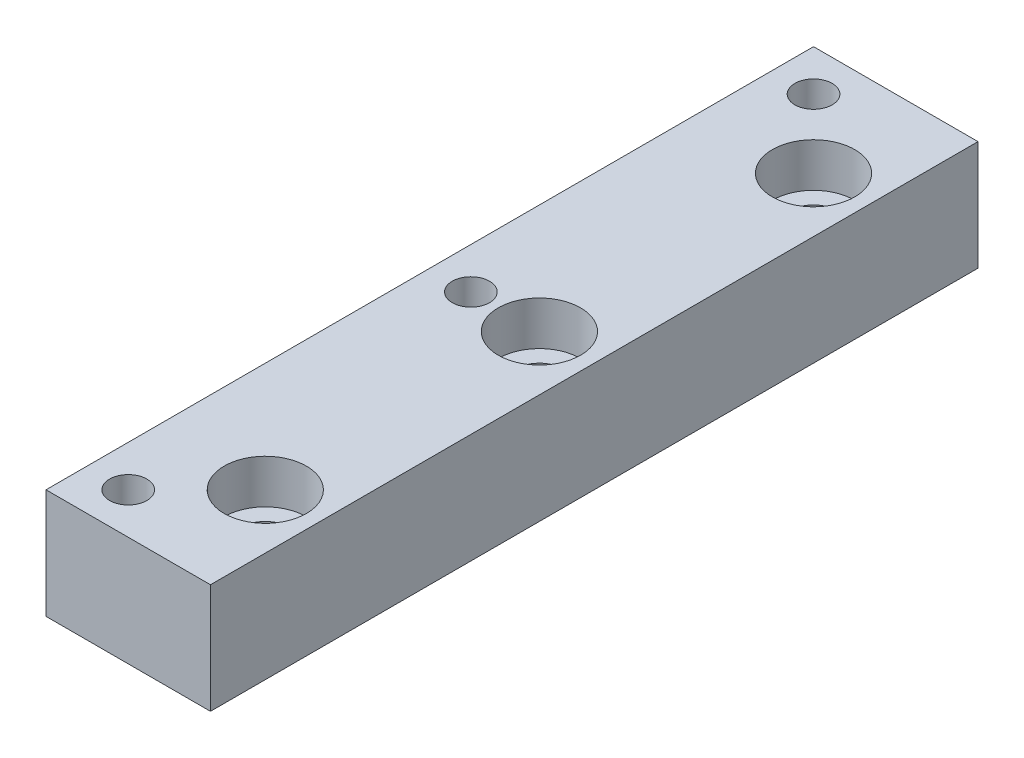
ISO-10303-21;
HEADER;
FILE_DESCRIPTION(('STEP AP214'),'2;1');
FILE_NAME('part.step','',(''),(''),'','','');
FILE_SCHEMA(('AUTOMOTIVE_DESIGN { 1 0 10303 214 1 1 1 1 }'));
ENDSEC;
DATA;
#1=APPLICATION_CONTEXT('core data for automotive mechanical design processes');
#2=APPLICATION_PROTOCOL_DEFINITION('international standard','automotive_design',2000,#1);
#3=PRODUCT_CONTEXT('',#1,'mechanical');
#4=PRODUCT('Part','Part','',(#3));
#5=PRODUCT_RELATED_PRODUCT_CATEGORY('part','',(#4));
#6=PRODUCT_DEFINITION_FORMATION('','',#4);
#7=PRODUCT_DEFINITION_CONTEXT('part definition',#1,'design');
#8=PRODUCT_DEFINITION('design','',#6,#7);
#9=PRODUCT_DEFINITION_SHAPE('','',#8);
#10=(LENGTH_UNIT() NAMED_UNIT(*) SI_UNIT(.MILLI.,.METRE.));
#11=(NAMED_UNIT(*) PLANE_ANGLE_UNIT() SI_UNIT($,.RADIAN.));
#12=(NAMED_UNIT(*) SI_UNIT($,.STERADIAN.) SOLID_ANGLE_UNIT());
#13=UNCERTAINTY_MEASURE_WITH_UNIT(LENGTH_MEASURE(1.E-05),#10,'distance_accuracy_value','');
#14=(GEOMETRIC_REPRESENTATION_CONTEXT(3) GLOBAL_UNCERTAINTY_ASSIGNED_CONTEXT((#13)) GLOBAL_UNIT_ASSIGNED_CONTEXT((#10,
#11,#12)) REPRESENTATION_CONTEXT('',''));
#15=CARTESIAN_POINT('',(0.,0.,0.));
#16=DIRECTION('',(0.,0.,1.));
#17=DIRECTION('',(1.,0.,0.));
#18=AXIS2_PLACEMENT_3D('',#15,#16,#17);
#19=CARTESIAN_POINT('',(0.,-2.22044604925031E-13,-70.0000000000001));
#20=DIRECTION('',(0.,-1.,0.));
#21=DIRECTION('',(0.,0.,-1.));
#22=AXIS2_PLACEMENT_3D('',#19,#20,#21);
#23=PLANE('',#22);
#24=CARTESIAN_POINT('',(19.9999999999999,0.,49.9999999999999));
#25=DIRECTION('',(0.,1.,0.));
#26=DIRECTION('',(0.,0.,1.));
#27=AXIS2_PLACEMENT_3D('',#24,#25,#26);
#28=CIRCLE('',#27,4.25);
#29=CARTESIAN_POINT('',(19.9999999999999,0.,54.2499999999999));
#30=VERTEX_POINT('',#29);
#31=EDGE_CURVE('E129',#30,#30,#28,.T.);
#32=ORIENTED_EDGE('',*,*,#31,.T.);
#33=EDGE_LOOP('',(#32));
#34=FACE_BOUND('',#33,.T.);
#35=CARTESIAN_POINT('',(20.,0.,-1.11022302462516E-13));
#36=DIRECTION('',(0.,1.,0.));
#37=DIRECTION('',(0.,0.,1.));
#38=AXIS2_PLACEMENT_3D('',#35,#36,#37);
#39=CIRCLE('',#38,4.25);
#40=CARTESIAN_POINT('',(20.,0.,4.24999999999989));
#41=VERTEX_POINT('',#40);
#42=EDGE_CURVE('E140',#41,#41,#39,.T.);
#43=ORIENTED_EDGE('',*,*,#42,.T.);
#44=EDGE_LOOP('',(#43));
#45=FACE_BOUND('',#44,.T.);
#46=CARTESIAN_POINT('',(20.,0.,-50.0000000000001));
#47=DIRECTION('',(0.,1.,0.));
#48=DIRECTION('',(0.,0.,1.));
#49=AXIS2_PLACEMENT_3D('',#46,#47,#48);
#50=CIRCLE('',#49,4.25);
#51=CARTESIAN_POINT('',(20.,0.,-45.7500000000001));
#52=VERTEX_POINT('',#51);
#53=EDGE_CURVE('E146',#52,#52,#50,.T.);
#54=ORIENTED_EDGE('',*,*,#53,.T.);
#55=EDGE_LOOP('',(#54));
#56=FACE_BOUND('',#55,.T.);
#57=CARTESIAN_POINT('',(7.50000000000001,0.,62.5));
#58=DIRECTION('',(0.,1.,0.));
#59=DIRECTION('',(0.,0.,1.));
#60=AXIS2_PLACEMENT_3D('',#57,#58,#59);
#61=CIRCLE('',#60,3.4);
#62=CARTESIAN_POINT('',(7.50000000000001,0.,65.9));
#63=VERTEX_POINT('',#62);
#64=EDGE_CURVE('E182',#63,#63,#61,.T.);
#65=ORIENTED_EDGE('',*,*,#64,.T.);
#66=EDGE_LOOP('',(#65));
#67=FACE_BOUND('',#66,.T.);
#68=CARTESIAN_POINT('',(7.50000000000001,0.,0.));
#69=DIRECTION('',(0.,1.,0.));
#70=DIRECTION('',(0.,0.,1.));
#71=AXIS2_PLACEMENT_3D('',#68,#69,#70);
#72=CIRCLE('',#71,3.4);
#73=CARTESIAN_POINT('',(7.50000000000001,0.,3.39999999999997));
#74=VERTEX_POINT('',#73);
#75=EDGE_CURVE('E158',#74,#74,#72,.T.);
#76=ORIENTED_EDGE('',*,*,#75,.T.);
#77=EDGE_LOOP('',(#76));
#78=FACE_BOUND('',#77,.T.);
#79=DIRECTION('',(0.999999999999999,0.,0.));
#80=VECTOR('',#79,1.);
#81=CARTESIAN_POINT('',(0.,0.,70.));
#82=LINE('',#81,#80);
#83=CARTESIAN_POINT('',(0.,0.,70.));
#84=VERTEX_POINT('',#83);
#85=CARTESIAN_POINT('',(30.,0.,69.9999999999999));
#86=VERTEX_POINT('',#85);
#87=EDGE_CURVE('E92',#84,#86,#82,.T.);
#88=ORIENTED_EDGE('',*,*,#87,.F.);
#89=DIRECTION('',(0.,0.,1.));
#90=VECTOR('',#89,1.);
#91=CARTESIAN_POINT('',(0.,-2.22044604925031E-13,-70.0000000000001));
#92=LINE('',#91,#90);
#93=CARTESIAN_POINT('',(0.,-2.22044604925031E-13,-70.0000000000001));
#94=VERTEX_POINT('',#93);
#95=EDGE_CURVE('E44',#94,#84,#92,.T.);
#96=ORIENTED_EDGE('',*,*,#95,.F.);
#97=DIRECTION('',(0.999999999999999,0.,0.));
#98=VECTOR('',#97,1.);
#99=CARTESIAN_POINT('',(0.,-2.22044604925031E-13,-70.0000000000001));
#100=LINE('',#99,#98);
#101=CARTESIAN_POINT('',(30.0000000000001,-2.77555756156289E-13,-70.0000000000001));
#102=VERTEX_POINT('',#101);
#103=EDGE_CURVE('E119',#94,#102,#100,.T.);
#104=ORIENTED_EDGE('',*,*,#103,.T.);
#105=DIRECTION('',(0.,0.,1.));
#106=VECTOR('',#105,1.);
#107=CARTESIAN_POINT('',(30.0000000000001,-2.77555756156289E-13,-70.0000000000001));
#108=LINE('',#107,#106);
#109=EDGE_CURVE('E89',#102,#86,#108,.T.);
#110=ORIENTED_EDGE('',*,*,#109,.T.);
#111=EDGE_LOOP('',(#88,#96,#104,#110));
#112=FACE_BOUND('',#111,.T.);
#113=CARTESIAN_POINT('',(7.50000000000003,-2.22044604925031E-13,-62.5));
#114=DIRECTION('',(0.,1.,0.));
#115=DIRECTION('',(0.,0.,1.));
#116=AXIS2_PLACEMENT_3D('',#113,#114,#115);
#117=CIRCLE('',#116,3.4);
#118=CARTESIAN_POINT('',(7.50000000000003,-2.22044604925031E-13,-59.1));
#119=VERTEX_POINT('',#118);
#120=EDGE_CURVE('E109',#119,#119,#117,.T.);
#121=ORIENTED_EDGE('',*,*,#120,.T.);
#122=EDGE_LOOP('',(#121));
#123=FACE_BOUND('',#122,.T.);
#124=ADVANCED_FACE('F40',(#34,#45,#56,#67,#78,#112,#123),#23,.T.);
#125=CARTESIAN_POINT('',(0.,-2.22044604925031E-13,-70.0000000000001));
#126=DIRECTION('',(-0.999999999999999,0.,0.));
#127=DIRECTION('',(0.,0.,1.));
#128=AXIS2_PLACEMENT_3D('',#125,#126,#127);
#129=PLANE('',#128);
#130=DIRECTION('',(0.,-1.,0.));
#131=VECTOR('',#130,1.);
#132=CARTESIAN_POINT('',(0.,0.,70.));
#133=LINE('',#132,#131);
#134=CARTESIAN_POINT('',(0.,20.,70.));
#135=VERTEX_POINT('',#134);
#136=EDGE_CURVE('E82',#135,#84,#133,.T.);
#137=ORIENTED_EDGE('',*,*,#136,.F.);
#138=DIRECTION('',(0.,0.,1.));
#139=VECTOR('',#138,1.);
#140=CARTESIAN_POINT('',(0.,19.9999999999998,-70.0000000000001));
#141=LINE('',#140,#139);
#142=CARTESIAN_POINT('',(0.,19.9999999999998,-70.0000000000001));
#143=VERTEX_POINT('',#142);
#144=EDGE_CURVE('E11',#143,#135,#141,.T.);
#145=ORIENTED_EDGE('',*,*,#144,.F.);
#146=DIRECTION('',(0.,-1.,0.));
#147=VECTOR('',#146,1.);
#148=CARTESIAN_POINT('',(0.,-2.22044604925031E-13,-70.0000000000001));
#149=LINE('',#148,#147);
#150=EDGE_CURVE('E84',#143,#94,#149,.T.);
#151=ORIENTED_EDGE('',*,*,#150,.T.);
#152=ORIENTED_EDGE('',*,*,#95,.T.);
#153=EDGE_LOOP('',(#137,#145,#151,#152));
#154=FACE_BOUND('',#153,.T.);
#155=ADVANCED_FACE('F42',(#154),#129,.T.);
#156=CARTESIAN_POINT('',(0.,19.9999999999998,-70.0000000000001));
#157=DIRECTION('',(0.,1.,0.));
#158=DIRECTION('',(0.,0.,1.));
#159=AXIS2_PLACEMENT_3D('',#156,#157,#158);
#160=PLANE('',#159);
#161=CARTESIAN_POINT('',(20.,20.,49.9999999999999));
#162=DIRECTION('',(0.,1.,0.));
#163=DIRECTION('',(0.,0.,1.));
#164=AXIS2_PLACEMENT_3D('',#161,#162,#163);
#165=CIRCLE('',#164,7.5);
#166=CARTESIAN_POINT('',(20.,20.,57.4999999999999));
#167=VERTEX_POINT('',#166);
#168=EDGE_CURVE('E138',#167,#167,#165,.T.);
#169=ORIENTED_EDGE('',*,*,#168,.F.);
#170=EDGE_LOOP('',(#169));
#171=FACE_BOUND('',#170,.T.);
#172=CARTESIAN_POINT('',(20.,20.,-1.38777878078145E-13));
#173=DIRECTION('',(0.,1.,0.));
#174=DIRECTION('',(0.,0.,1.));
#175=AXIS2_PLACEMENT_3D('',#172,#173,#174);
#176=CIRCLE('',#175,7.5);
#177=CARTESIAN_POINT('',(20.,20.,7.49999999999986));
#178=VERTEX_POINT('',#177);
#179=EDGE_CURVE('E143',#178,#178,#176,.T.);
#180=ORIENTED_EDGE('',*,*,#179,.F.);
#181=EDGE_LOOP('',(#180));
#182=FACE_BOUND('',#181,.T.);
#183=CARTESIAN_POINT('',(20.,20.,-50.0000000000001));
#184=DIRECTION('',(0.,1.,0.));
#185=DIRECTION('',(0.,0.,1.));
#186=AXIS2_PLACEMENT_3D('',#183,#184,#185);
#187=CIRCLE('',#186,7.5);
#188=CARTESIAN_POINT('',(20.,20.,-42.5000000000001));
#189=VERTEX_POINT('',#188);
#190=EDGE_CURVE('E178',#189,#189,#187,.T.);
#191=ORIENTED_EDGE('',*,*,#190,.F.);
#192=EDGE_LOOP('',(#191));
#193=FACE_BOUND('',#192,.T.);
#194=CARTESIAN_POINT('',(7.50000000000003,20.,62.5));
#195=DIRECTION('',(0.,1.,0.));
#196=DIRECTION('',(0.,0.,1.));
#197=AXIS2_PLACEMENT_3D('',#194,#195,#196);
#198=CIRCLE('',#197,3.4);
#199=CARTESIAN_POINT('',(7.50000000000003,20.,65.9));
#200=VERTEX_POINT('',#199);
#201=EDGE_CURVE('E186',#200,#200,#198,.T.);
#202=ORIENTED_EDGE('',*,*,#201,.F.);
#203=EDGE_LOOP('',(#202));
#204=FACE_BOUND('',#203,.T.);
#205=CARTESIAN_POINT('',(7.49999999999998,20.,0.));
#206=DIRECTION('',(0.,1.,0.));
#207=DIRECTION('',(0.,0.,1.));
#208=AXIS2_PLACEMENT_3D('',#205,#206,#207);
#209=CIRCLE('',#208,3.4);
#210=CARTESIAN_POINT('',(7.49999999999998,20.,3.39999999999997));
#211=VERTEX_POINT('',#210);
#212=EDGE_CURVE('E151',#211,#211,#209,.T.);
#213=ORIENTED_EDGE('',*,*,#212,.F.);
#214=EDGE_LOOP('',(#213));
#215=FACE_BOUND('',#214,.T.);
#216=CARTESIAN_POINT('',(7.49999999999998,19.9999999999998,-62.5));
#217=DIRECTION('',(0.,1.,0.));
#218=DIRECTION('',(0.,0.,1.));
#219=AXIS2_PLACEMENT_3D('',#216,#217,#218);
#220=CIRCLE('',#219,3.4);
#221=CARTESIAN_POINT('',(7.49999999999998,19.9999999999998,-59.1));
#222=VERTEX_POINT('',#221);
#223=EDGE_CURVE('E103',#222,#222,#220,.T.);
#224=ORIENTED_EDGE('',*,*,#223,.F.);
#225=EDGE_LOOP('',(#224));
#226=FACE_BOUND('',#225,.T.);
#227=DIRECTION('',(-0.999999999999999,0.,0.));
#228=VECTOR('',#227,1.);
#229=CARTESIAN_POINT('',(0.,20.,70.));
#230=LINE('',#229,#228);
#231=CARTESIAN_POINT('',(30.,20.,69.9999999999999));
#232=VERTEX_POINT('',#231);
#233=EDGE_CURVE('E101',#232,#135,#230,.T.);
#234=ORIENTED_EDGE('',*,*,#233,.F.);
#235=DIRECTION('',(0.,0.,1.));
#236=VECTOR('',#235,1.);
#237=CARTESIAN_POINT('',(30.,19.9999999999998,-70.0000000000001));
#238=LINE('',#237,#236);
#239=CARTESIAN_POINT('',(30.,19.9999999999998,-70.0000000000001));
#240=VERTEX_POINT('',#239);
#241=EDGE_CURVE('E50',#240,#232,#238,.T.);
#242=ORIENTED_EDGE('',*,*,#241,.F.);
#243=DIRECTION('',(-0.999999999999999,0.,0.));
#244=VECTOR('',#243,1.);
#245=CARTESIAN_POINT('',(0.,19.9999999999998,-70.0000000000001));
#246=LINE('',#245,#244);
#247=EDGE_CURVE('E90',#240,#143,#246,.T.);
#248=ORIENTED_EDGE('',*,*,#247,.T.);
#249=ORIENTED_EDGE('',*,*,#144,.T.);
#250=EDGE_LOOP('',(#234,#242,#248,#249));
#251=FACE_BOUND('',#250,.T.);
#252=ADVANCED_FACE('F203',(#171,#182,#193,#204,#215,#226,#251),#160,.T.);
#253=CARTESIAN_POINT('',(30.0000000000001,-2.77555756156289E-13,-70.0000000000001));
#254=DIRECTION('',(0.999999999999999,0.,0.));
#255=DIRECTION('',(0.,0.,-1.));
#256=AXIS2_PLACEMENT_3D('',#253,#254,#255);
#257=PLANE('',#256);
#258=DIRECTION('',(0.,1.,0.));
#259=VECTOR('',#258,1.);
#260=CARTESIAN_POINT('',(30.,0.,69.9999999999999));
#261=LINE('',#260,#259);
#262=EDGE_CURVE('E98',#86,#232,#261,.T.);
#263=ORIENTED_EDGE('',*,*,#262,.F.);
#264=ORIENTED_EDGE('',*,*,#109,.F.);
#265=DIRECTION('',(0.,1.,0.));
#266=VECTOR('',#265,1.);
#267=CARTESIAN_POINT('',(30.0000000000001,-2.77555756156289E-13,-70.0000000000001));
#268=LINE('',#267,#266);
#269=EDGE_CURVE('E122',#102,#240,#268,.T.);
#270=ORIENTED_EDGE('',*,*,#269,.T.);
#271=ORIENTED_EDGE('',*,*,#241,.T.);
#272=EDGE_LOOP('',(#263,#264,#270,#271));
#273=FACE_BOUND('',#272,.T.);
#274=ADVANCED_FACE('F206',(#273),#257,.T.);
#275=CARTESIAN_POINT('',(0.,19.9999999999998,-70.0000000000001));
#276=DIRECTION('',(0.,0.,-1.));
#277=DIRECTION('',(-0.999999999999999,0.,0.));
#278=AXIS2_PLACEMENT_3D('',#275,#276,#277);
#279=PLANE('',#278);
#280=ORIENTED_EDGE('',*,*,#150,.F.);
#281=ORIENTED_EDGE('',*,*,#247,.F.);
#282=ORIENTED_EDGE('',*,*,#269,.F.);
#283=ORIENTED_EDGE('',*,*,#103,.F.);
#284=EDGE_LOOP('',(#280,#281,#282,#283));
#285=FACE_BOUND('',#284,.T.);
#286=ADVANCED_FACE('F213',(#285),#279,.T.);
#287=CARTESIAN_POINT('',(0.,20.,70.));
#288=DIRECTION('',(0.,0.,-1.));
#289=DIRECTION('',(-0.999999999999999,0.,0.));
#290=AXIS2_PLACEMENT_3D('',#287,#288,#289);
#291=PLANE('',#290);
#292=ORIENTED_EDGE('',*,*,#136,.T.);
#293=ORIENTED_EDGE('',*,*,#87,.T.);
#294=ORIENTED_EDGE('',*,*,#262,.T.);
#295=ORIENTED_EDGE('',*,*,#233,.T.);
#296=EDGE_LOOP('',(#292,#293,#294,#295));
#297=FACE_BOUND('',#296,.T.);
#298=ADVANCED_FACE('F100',(#297),#291,.F.);
#299=CARTESIAN_POINT('',(7.49999999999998,19.9999999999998,-62.5));
#300=DIRECTION('',(0.,1.,0.));
#301=DIRECTION('',(0.,0.,1.));
#302=AXIS2_PLACEMENT_3D('',#299,#300,#301);
#303=CYLINDRICAL_SURFACE('',#302,3.4);
#304=ORIENTED_EDGE('',*,*,#120,.F.);
#305=EDGE_LOOP('',(#304));
#306=FACE_BOUND('',#305,.T.);
#307=ORIENTED_EDGE('',*,*,#223,.T.);
#308=EDGE_LOOP('',(#307));
#309=FACE_BOUND('',#308,.T.);
#310=ADVANCED_FACE('F199',(#306,#309),#303,.F.);
#311=CARTESIAN_POINT('',(7.49999999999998,20.,0.));
#312=DIRECTION('',(0.,1.,0.));
#313=DIRECTION('',(0.,0.,1.));
#314=AXIS2_PLACEMENT_3D('',#311,#312,#313);
#315=CYLINDRICAL_SURFACE('',#314,3.4);
#316=ORIENTED_EDGE('',*,*,#75,.F.);
#317=EDGE_LOOP('',(#316));
#318=FACE_BOUND('',#317,.T.);
#319=ORIENTED_EDGE('',*,*,#212,.T.);
#320=EDGE_LOOP('',(#319));
#321=FACE_BOUND('',#320,.T.);
#322=ADVANCED_FACE('F195',(#318,#321),#315,.F.);
#323=CARTESIAN_POINT('',(7.50000000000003,20.,62.5));
#324=DIRECTION('',(0.,1.,0.));
#325=DIRECTION('',(0.,0.,1.));
#326=AXIS2_PLACEMENT_3D('',#323,#324,#325);
#327=CYLINDRICAL_SURFACE('',#326,3.4);
#328=ORIENTED_EDGE('',*,*,#64,.F.);
#329=EDGE_LOOP('',(#328));
#330=FACE_BOUND('',#329,.T.);
#331=ORIENTED_EDGE('',*,*,#201,.T.);
#332=EDGE_LOOP('',(#331));
#333=FACE_BOUND('',#332,.T.);
#334=ADVANCED_FACE('F198',(#330,#333),#327,.F.);
#335=CARTESIAN_POINT('',(20.,20.,-50.0000000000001));
#336=DIRECTION('',(0.,1.,0.));
#337=DIRECTION('',(0.,0.,1.));
#338=AXIS2_PLACEMENT_3D('',#335,#336,#337);
#339=CYLINDRICAL_SURFACE('',#338,7.5);
#340=CARTESIAN_POINT('',(20.,12.,-50.0000000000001));
#341=DIRECTION('',(0.,1.,0.));
#342=DIRECTION('',(0.,0.,1.));
#343=AXIS2_PLACEMENT_3D('',#340,#341,#342);
#344=CIRCLE('',#343,7.5);
#345=CARTESIAN_POINT('',(20.,12.,-42.5000000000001));
#346=VERTEX_POINT('',#345);
#347=EDGE_CURVE('E163',#346,#346,#344,.T.);
#348=ORIENTED_EDGE('',*,*,#347,.F.);
#349=EDGE_LOOP('',(#348));
#350=FACE_BOUND('',#349,.T.);
#351=ORIENTED_EDGE('',*,*,#190,.T.);
#352=EDGE_LOOP('',(#351));
#353=FACE_BOUND('',#352,.T.);
#354=ADVANCED_FACE('F236',(#350,#353),#339,.F.);
#355=CARTESIAN_POINT('',(24.25,12.,-50.0000000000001));
#356=DIRECTION('',(0.,-1.,0.));
#357=DIRECTION('',(0.,0.,-1.));
#358=AXIS2_PLACEMENT_3D('',#355,#356,#357);
#359=PLANE('',#358);
#360=CARTESIAN_POINT('',(20.,12.,-50.0000000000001));
#361=DIRECTION('',(0.,1.,0.));
#362=DIRECTION('',(0.,0.,1.));
#363=AXIS2_PLACEMENT_3D('',#360,#361,#362);
#364=CIRCLE('',#363,4.25);
#365=CARTESIAN_POINT('',(20.,12.,-45.7500000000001));
#366=VERTEX_POINT('',#365);
#367=EDGE_CURVE('E160',#366,#366,#364,.T.);
#368=ORIENTED_EDGE('',*,*,#367,.F.);
#369=EDGE_LOOP('',(#368));
#370=FACE_BOUND('',#369,.T.);
#371=ORIENTED_EDGE('',*,*,#347,.T.);
#372=EDGE_LOOP('',(#371));
#373=FACE_BOUND('',#372,.T.);
#374=ADVANCED_FACE('F243',(#370,#373),#359,.F.);
#375=CARTESIAN_POINT('',(20.,20.,-50.0000000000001));
#376=DIRECTION('',(0.,1.,0.));
#377=DIRECTION('',(0.,0.,1.));
#378=AXIS2_PLACEMENT_3D('',#375,#376,#377);
#379=CYLINDRICAL_SURFACE('',#378,4.25);
#380=ORIENTED_EDGE('',*,*,#53,.F.);
#381=EDGE_LOOP('',(#380));
#382=FACE_BOUND('',#381,.T.);
#383=ORIENTED_EDGE('',*,*,#367,.T.);
#384=EDGE_LOOP('',(#383));
#385=FACE_BOUND('',#384,.T.);
#386=ADVANCED_FACE('F283',(#382,#385),#379,.F.);
#387=CARTESIAN_POINT('',(20.,20.,-1.38777878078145E-13));
#388=DIRECTION('',(0.,1.,0.));
#389=DIRECTION('',(0.,0.,1.));
#390=AXIS2_PLACEMENT_3D('',#387,#388,#389);
#391=CYLINDRICAL_SURFACE('',#390,7.5);
#392=CARTESIAN_POINT('',(20.,12.,-1.11022302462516E-13));
#393=DIRECTION('',(0.,1.,0.));
#394=DIRECTION('',(0.,0.,1.));
#395=AXIS2_PLACEMENT_3D('',#392,#393,#394);
#396=CIRCLE('',#395,7.5);
#397=CARTESIAN_POINT('',(20.,12.,7.49999999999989));
#398=VERTEX_POINT('',#397);
#399=EDGE_CURVE('E147',#398,#398,#396,.T.);
#400=ORIENTED_EDGE('',*,*,#399,.F.);
#401=EDGE_LOOP('',(#400));
#402=FACE_BOUND('',#401,.T.);
#403=ORIENTED_EDGE('',*,*,#179,.T.);
#404=EDGE_LOOP('',(#403));
#405=FACE_BOUND('',#404,.T.);
#406=ADVANCED_FACE('F291',(#402,#405),#391,.F.);
#407=CARTESIAN_POINT('',(24.25,12.,-1.11022302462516E-13));
#408=DIRECTION('',(0.,-1.,0.));
#409=DIRECTION('',(0.,0.,-1.));
#410=AXIS2_PLACEMENT_3D('',#407,#408,#409);
#411=PLANE('',#410);
#412=CARTESIAN_POINT('',(20.,12.,-1.11022302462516E-13));
#413=DIRECTION('',(0.,1.,0.));
#414=DIRECTION('',(0.,0.,1.));
#415=AXIS2_PLACEMENT_3D('',#412,#413,#414);
#416=CIRCLE('',#415,4.25);
#417=CARTESIAN_POINT('',(20.,12.,4.24999999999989));
#418=VERTEX_POINT('',#417);
#419=EDGE_CURVE('E152',#418,#418,#416,.T.);
#420=ORIENTED_EDGE('',*,*,#419,.F.);
#421=EDGE_LOOP('',(#420));
#422=FACE_BOUND('',#421,.T.);
#423=ORIENTED_EDGE('',*,*,#399,.T.);
#424=EDGE_LOOP('',(#423));
#425=FACE_BOUND('',#424,.T.);
#426=ADVANCED_FACE('F300',(#422,#425),#411,.F.);
#427=CARTESIAN_POINT('',(20.,20.,-1.38777878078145E-13));
#428=DIRECTION('',(0.,1.,0.));
#429=DIRECTION('',(0.,0.,1.));
#430=AXIS2_PLACEMENT_3D('',#427,#428,#429);
#431=CYLINDRICAL_SURFACE('',#430,4.25);
#432=ORIENTED_EDGE('',*,*,#42,.F.);
#433=EDGE_LOOP('',(#432));
#434=FACE_BOUND('',#433,.T.);
#435=ORIENTED_EDGE('',*,*,#419,.T.);
#436=EDGE_LOOP('',(#435));
#437=FACE_BOUND('',#436,.T.);
#438=ADVANCED_FACE('F309',(#434,#437),#431,.F.);
#439=CARTESIAN_POINT('',(20.,20.,49.9999999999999));
#440=DIRECTION('',(0.,1.,0.));
#441=DIRECTION('',(0.,0.,1.));
#442=AXIS2_PLACEMENT_3D('',#439,#440,#441);
#443=CYLINDRICAL_SURFACE('',#442,7.5);
#444=CARTESIAN_POINT('',(20.,12.,49.9999999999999));
#445=DIRECTION('',(0.,1.,0.));
#446=DIRECTION('',(0.,0.,1.));
#447=AXIS2_PLACEMENT_3D('',#444,#445,#446);
#448=CIRCLE('',#447,7.5);
#449=CARTESIAN_POINT('',(20.,12.,57.4999999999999));
#450=VERTEX_POINT('',#449);
#451=EDGE_CURVE('E135',#450,#450,#448,.T.);
#452=ORIENTED_EDGE('',*,*,#451,.F.);
#453=EDGE_LOOP('',(#452));
#454=FACE_BOUND('',#453,.T.);
#455=ORIENTED_EDGE('',*,*,#168,.T.);
#456=EDGE_LOOP('',(#455));
#457=FACE_BOUND('',#456,.T.);
#458=ADVANCED_FACE('F318',(#454,#457),#443,.F.);
#459=CARTESIAN_POINT('',(24.25,12.,49.9999999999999));
#460=DIRECTION('',(0.,-1.,0.));
#461=DIRECTION('',(0.,0.,-1.));
#462=AXIS2_PLACEMENT_3D('',#459,#460,#461);
#463=PLANE('',#462);
#464=CARTESIAN_POINT('',(20.,12.,49.9999999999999));
#465=DIRECTION('',(0.,1.,0.));
#466=DIRECTION('',(0.,0.,1.));
#467=AXIS2_PLACEMENT_3D('',#464,#465,#466);
#468=CIRCLE('',#467,4.25);
#469=CARTESIAN_POINT('',(20.,12.,54.2499999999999));
#470=VERTEX_POINT('',#469);
#471=EDGE_CURVE('E132',#470,#470,#468,.T.);
#472=ORIENTED_EDGE('',*,*,#471,.F.);
#473=EDGE_LOOP('',(#472));
#474=FACE_BOUND('',#473,.T.);
#475=ORIENTED_EDGE('',*,*,#451,.T.);
#476=EDGE_LOOP('',(#475));
#477=FACE_BOUND('',#476,.T.);
#478=ADVANCED_FACE('F327',(#474,#477),#463,.F.);
#479=CARTESIAN_POINT('',(20.,20.,49.9999999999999));
#480=DIRECTION('',(0.,1.,0.));
#481=DIRECTION('',(0.,0.,1.));
#482=AXIS2_PLACEMENT_3D('',#479,#480,#481);
#483=CYLINDRICAL_SURFACE('',#482,4.25);
#484=ORIENTED_EDGE('',*,*,#31,.F.);
#485=EDGE_LOOP('',(#484));
#486=FACE_BOUND('',#485,.T.);
#487=ORIENTED_EDGE('',*,*,#471,.T.);
#488=EDGE_LOOP('',(#487));
#489=FACE_BOUND('',#488,.T.);
#490=ADVANCED_FACE('F336',(#486,#489),#483,.F.);
#491=CLOSED_SHELL('',(#124,#155,#252,#274,#286,#298,#310,#322,#334,#354,#374,#386,#406,#426,
#438,#458,#478,#490));
#492=MANIFOLD_SOLID_BREP('B2',#491);
#493=ADVANCED_BREP_SHAPE_REPRESENTATION('',(#18,#492),#14);
#494=SHAPE_DEFINITION_REPRESENTATION(#9,#493);
ENDSEC;
END-ISO-10303-21;
